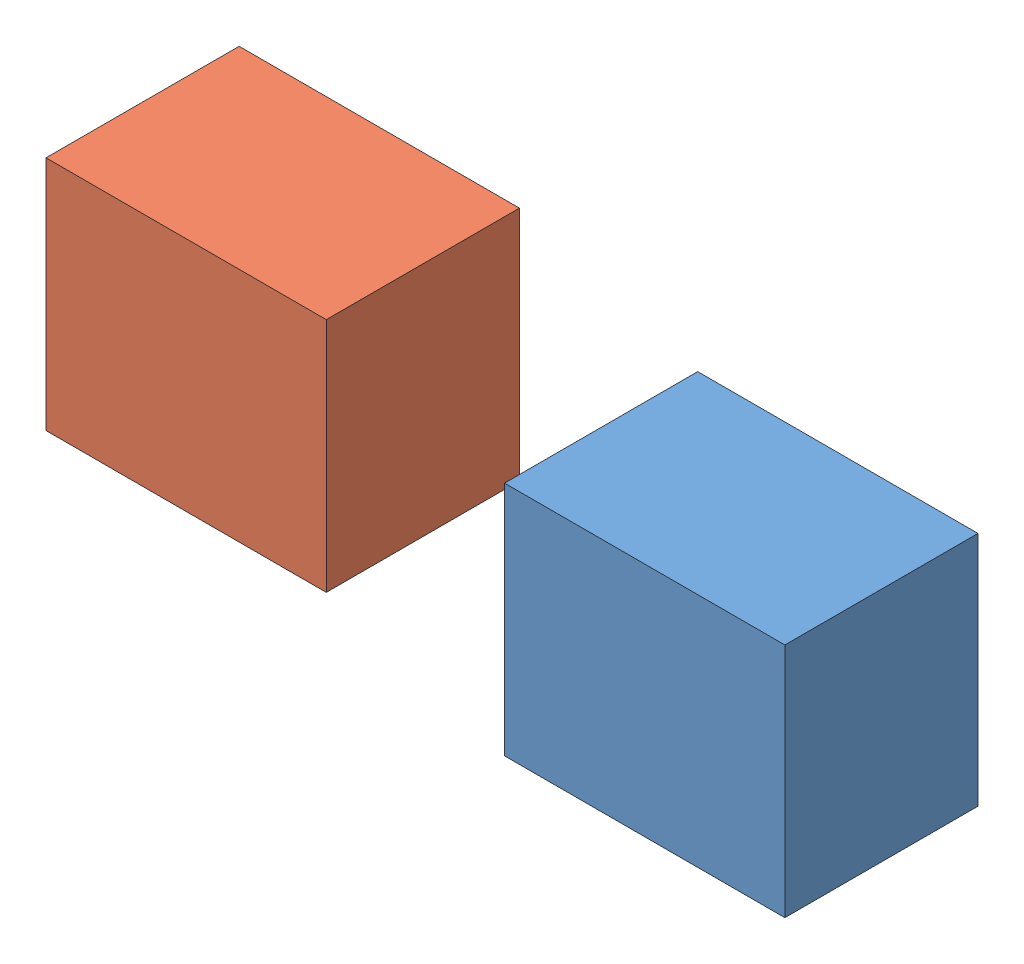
SolidWorks assembly DistanceMate.SLDASM, configuration Default (file format 4700). Lengths in mm.
Overall size (209.13 63.14 65.6).
2 component instances, 2 part files, 0 mates.
Components (placement in the parent):
- Block1-1: Block1.SLDPRT [Default] at origin size (73.72 62.13 50.8)
- Block2-1: Block2.SLDPRT [Default] at (-135.4119 -1.0075 -14.8023) size (73.72 62.13 50.8)
